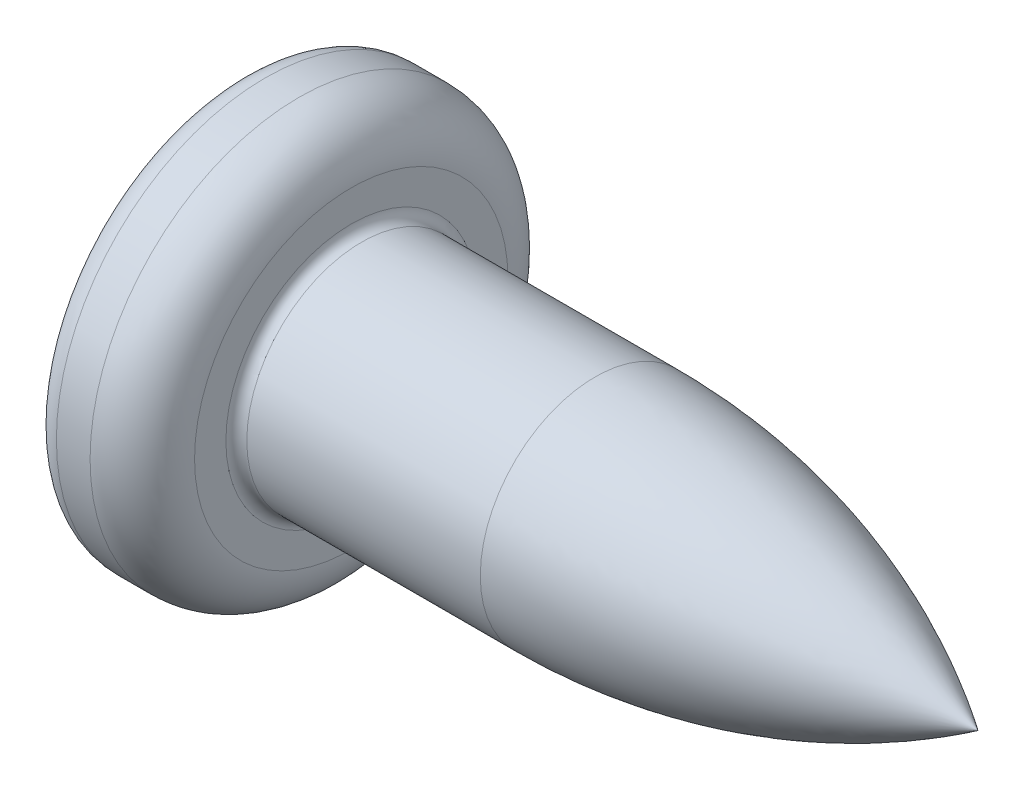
from build123d import *

# Parameters (mm, degrees)
FILLET1_R    = 0.1
RECPAT_COUNT = 2
RECPAT_ANGLE = 90


with BuildPart() as part:
    # BodySke → Base-Revolve (revolve)
    with BuildSketch(Plane.XY, mode=Mode.PRIVATE) as base_revolve_sk:
        with BuildLine():
            Line((1.5, 1.1), (1.5, 1.5))
            ThreePointArc((1.5, 1.5), (1.353553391, 1.853553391), (1, 2))
            Line((1, 2), (0.677350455, 2))
            ThreePointArc((0.677350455, 2), (0.553579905, 1.96562308), (0.465266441, 1.872340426))
            ThreePointArc((0.465266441, 1.872340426), (0.118058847, 0.964641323), (0, 0))
            Line((0, 0), (7.5, 0))
            ThreePointArc((7.5, 0), (5.748444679, 0.819069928), (3.835358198, 1.1))
            Line((3.835358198, 1.1), (1.5, 1.1))
        make_face()
    revolve(base_revolve_sk.sketch.rotate(Axis((3.835358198, 0, 0), (1, 0, 0)), 90), axis=Axis((3.835358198, 0, 0), (1, 0, 0)))

    # Fillet1
    fillet1_edges = [part.edges().sort_by_distance(p)[0] for p in [
        (1.5, 0, -1.1),
    ]]
    fillet(fillet1_edges, radius=FILLET1_R)

    # Sketch3 → Recess section 0
    with BuildSketch(Plane(origin=(0, 0, 0), x_dir=(0, 0, -1), z_dir=(1, 0, 0))):
        with BuildLine():
            Line((0.37, -1.3), (-0.37, -1.3))
            Line((-0.37, -1.3), (-0.37, 1.3))
            Line((-0.37, 1.3), (0.37, 1.3))
            Line((0.37, 1.3), (0.37, -1.3))
        make_face()
    # Sketch4 → Recess section 1
    with BuildSketch(Plane(origin=(1.5, 0, 0), x_dir=(0, 0, -1), z_dir=(1, 0, 0))):
        with BuildLine():
            Line((0.37, -0.552127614), (-0.37, -0.552127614))
            Line((-0.37, -0.552127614), (-0.37, 0.552127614))
            Line((-0.37, 0.552127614), (0.37, 0.552127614))
            Line((0.37, 0.552127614), (0.37, -0.552127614))
        make_face()
    recess = loft(mode=Mode.SUBTRACT)

    # RecPat: Recess ×2 about axis
    recpat_axis = Axis((0, 0, 0), (1, 0, 0))
    for i in range(1, RECPAT_COUNT):
        add(recess.rotate(recpat_axis, i * RECPAT_ANGLE / (RECPAT_COUNT - 1)), mode=Mode.SUBTRACT)

    # RecCorSke → RecessCore (revolve, cut)
    with BuildSketch(Plane.XY, mode=Mode.PRIVATE) as recesscore_sk:
        Polygon((0, 0), (0, 0.660890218), (1.5, 0.556), (1.680655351, 0), align=None)
    revolve(recesscore_sk.sketch.rotate(Axis((-3.175, 0, 0), (1, 0, 0)), 17.145865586), axis=Axis((-3.175, 0, 0), (1, 0, 0)), mode=Mode.SUBTRACT)


solid = part.part
